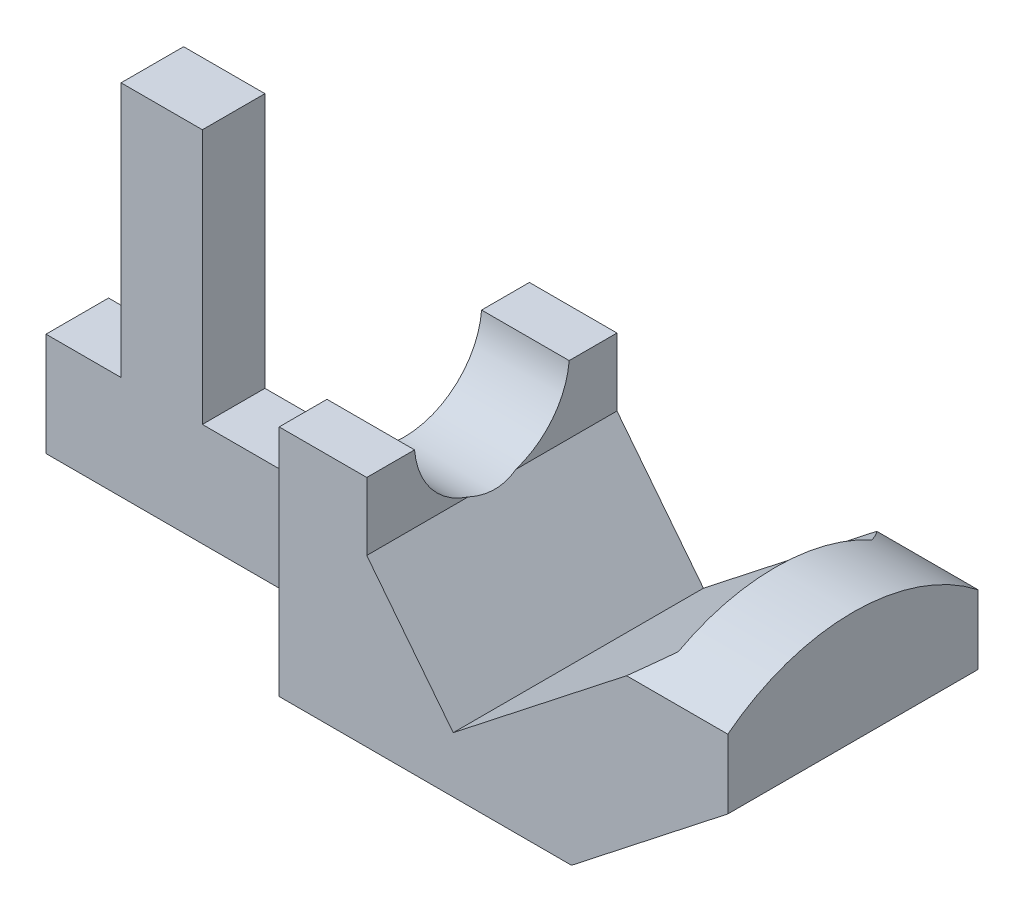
ISO-10303-21;
HEADER;
FILE_DESCRIPTION(('STEP AP214'),'2;1');
FILE_NAME('part.step','',(''),(''),'','','');
FILE_SCHEMA(('AUTOMOTIVE_DESIGN { 1 0 10303 214 1 1 1 1 }'));
ENDSEC;
DATA;
#1=APPLICATION_CONTEXT('core data for automotive mechanical design processes');
#2=APPLICATION_PROTOCOL_DEFINITION('international standard','automotive_design',2000,#1);
#3=PRODUCT_CONTEXT('',#1,'mechanical');
#4=PRODUCT('Part','Part','',(#3));
#5=PRODUCT_RELATED_PRODUCT_CATEGORY('part','',(#4));
#6=PRODUCT_DEFINITION_FORMATION('','',#4);
#7=PRODUCT_DEFINITION_CONTEXT('part definition',#1,'design');
#8=PRODUCT_DEFINITION('design','',#6,#7);
#9=PRODUCT_DEFINITION_SHAPE('','',#8);
#10=(LENGTH_UNIT() NAMED_UNIT(*) SI_UNIT(.MILLI.,.METRE.));
#11=(NAMED_UNIT(*) PLANE_ANGLE_UNIT() SI_UNIT($,.RADIAN.));
#12=(NAMED_UNIT(*) SI_UNIT($,.STERADIAN.) SOLID_ANGLE_UNIT());
#13=UNCERTAINTY_MEASURE_WITH_UNIT(LENGTH_MEASURE(1.E-05),#10,'distance_accuracy_value','');
#14=(GEOMETRIC_REPRESENTATION_CONTEXT(3) GLOBAL_UNCERTAINTY_ASSIGNED_CONTEXT((#13)) GLOBAL_UNIT_ASSIGNED_CONTEXT((#10,
#11,#12)) REPRESENTATION_CONTEXT('',''));
#15=CARTESIAN_POINT('',(0.,0.,0.));
#16=DIRECTION('',(0.,0.,1.));
#17=DIRECTION('',(1.,0.,0.));
#18=AXIS2_PLACEMENT_3D('',#15,#16,#17);
#19=CARTESIAN_POINT('',(-55.5873395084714,42.2351625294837,-3.175));
#20=DIRECTION('',(1.,0.,0.));
#21=DIRECTION('',(0.,0.,-1.));
#22=AXIS2_PLACEMENT_3D('',#19,#20,#21);
#23=PLANE('',#22);
#24=DIRECTION('',(0.,0.,1.));
#25=VECTOR('',#24,1.);
#26=CARTESIAN_POINT('',(-55.5873395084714,49.0931625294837,-12.700025));
#27=LINE('',#26,#25);
#28=CARTESIAN_POINT('',(-55.5873395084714,49.0931625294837,7.84847840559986));
#29=VERTEX_POINT('',#28);
#30=CARTESIAN_POINT('',(-55.5873395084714,49.0931625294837,12.7));
#31=VERTEX_POINT('',#30);
#32=EDGE_CURVE('E54',#29,#31,#27,.T.);
#33=ORIENTED_EDGE('',*,*,#32,.T.);
#34=DIRECTION('',(0.,1.,0.));
#35=VECTOR('',#34,1.);
#36=CARTESIAN_POINT('',(-55.5873395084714,53.2268754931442,12.7));
#37=LINE('',#36,#35);
#38=CARTESIAN_POINT('',(-55.5873395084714,42.2351625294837,12.7));
#39=VERTEX_POINT('',#38);
#40=EDGE_CURVE('E334',#39,#31,#37,.T.);
#41=ORIENTED_EDGE('',*,*,#40,.F.);
#42=DIRECTION('',(0.,0.,1.));
#43=VECTOR('',#42,1.);
#44=CARTESIAN_POINT('',(-55.5873395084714,42.2351625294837,-3.175));
#45=LINE('',#44,#43);
#46=CARTESIAN_POINT('',(-55.5873395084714,42.2351625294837,2.42446030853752));
#47=VERTEX_POINT('',#46);
#48=EDGE_CURVE('E195',#47,#39,#45,.T.);
#49=ORIENTED_EDGE('',*,*,#48,.F.);
#50=CARTESIAN_POINT('',(-55.5873395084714,49.7266155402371,0.));
#51=DIRECTION('',(1.,0.,0.));
#52=DIRECTION('',(0.,0.,-1.));
#53=AXIS2_PLACEMENT_3D('',#50,#51,#52);
#54=CIRCLE('',#53,7.874);
#55=EDGE_CURVE('E278',#29,#47,#54,.T.);
#56=ORIENTED_EDGE('',*,*,#55,.F.);
#57=EDGE_LOOP('',(#33,#41,#49,#56));
#58=FACE_BOUND('',#57,.T.);
#59=ADVANCED_FACE('F32',(#58),#23,.T.);
#60=CARTESIAN_POINT('',(-55.5873395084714,49.0931625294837,-12.7));
#61=VERTEX_POINT('',#60);
#62=CARTESIAN_POINT('',(-55.5873395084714,49.0931625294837,-7.84847840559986));
#63=VERTEX_POINT('',#62);
#64=EDGE_CURVE('E396',#61,#63,#27,.T.);
#65=ORIENTED_EDGE('',*,*,#64,.T.);
#66=CARTESIAN_POINT('',(-55.5873395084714,42.2351625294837,-2.42446030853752));
#67=VERTEX_POINT('',#66);
#68=EDGE_CURVE('E404',#67,#63,#54,.T.);
#69=ORIENTED_EDGE('',*,*,#68,.F.);
#70=CARTESIAN_POINT('',(-55.5873395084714,42.2351625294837,-12.7));
#71=VERTEX_POINT('',#70);
#72=EDGE_CURVE('E225',#71,#67,#45,.T.);
#73=ORIENTED_EDGE('',*,*,#72,.F.);
#74=DIRECTION('',(0.,1.,0.));
#75=VECTOR('',#74,1.);
#76=CARTESIAN_POINT('',(-55.5873395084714,53.2268754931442,-12.7));
#77=LINE('',#76,#75);
#78=EDGE_CURVE('E286',#71,#61,#77,.T.);
#79=ORIENTED_EDGE('',*,*,#78,.T.);
#80=EDGE_LOOP('',(#65,#69,#73,#79));
#81=FACE_BOUND('',#80,.T.);
#82=ADVANCED_FACE('F416',(#81),#23,.T.);
#83=CARTESIAN_POINT('',(-48.7685627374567,33.5429165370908,-3.175));
#84=DIRECTION('',(0.786795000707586,0.617214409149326,0.));
#85=DIRECTION('',(-0.617214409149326,0.786795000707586,0.));
#86=AXIS2_PLACEMENT_3D('',#83,#84,#85);
#87=PLANE('',#86);
#88=ORIENTED_EDGE('',*,*,#72,.T.);
#89=CARTESIAN_POINT('',(-61.4641342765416,49.7266155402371,0.));
#90=DIRECTION('',(0.786795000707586,0.617214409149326,0.));
#91=DIRECTION('',(-0.617214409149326,0.786795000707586,0.));
#92=AXIS2_PLACEMENT_3D('',#89,#90,#91);
#93=ELLIPSE('',#92,10.0076894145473,7.874);
#94=EDGE_CURVE('E277',#47,#67,#93,.T.);
#95=ORIENTED_EDGE('',*,*,#94,.F.);
#96=ORIENTED_EDGE('',*,*,#48,.T.);
#97=DIRECTION('',(-0.617214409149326,0.786795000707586,0.));
#98=VECTOR('',#97,1.);
#99=CARTESIAN_POINT('',(-46.8089069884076,31.0448424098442,12.7));
#100=LINE('',#99,#98);
#101=CARTESIAN_POINT('',(-46.8089069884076,31.0448424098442,12.7));
#102=VERTEX_POINT('',#101);
#103=EDGE_CURVE('E331',#102,#39,#100,.T.);
#104=ORIENTED_EDGE('',*,*,#103,.F.);
#105=DIRECTION('',(0.,0.,1.));
#106=VECTOR('',#105,1.);
#107=CARTESIAN_POINT('',(-46.8089069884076,31.0448424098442,-3.175));
#108=LINE('',#107,#106);
#109=CARTESIAN_POINT('',(-46.8089069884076,31.0448424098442,-12.7));
#110=VERTEX_POINT('',#109);
#111=EDGE_CURVE('E192',#110,#102,#108,.T.);
#112=ORIENTED_EDGE('',*,*,#111,.F.);
#113=DIRECTION('',(-0.617214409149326,0.786795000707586,0.));
#114=VECTOR('',#113,1.);
#115=CARTESIAN_POINT('',(-46.8089069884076,31.0448424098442,-12.7));
#116=LINE('',#115,#114);
#117=EDGE_CURVE('E289',#110,#71,#116,.T.);
#118=ORIENTED_EDGE('',*,*,#117,.T.);
#119=EDGE_LOOP('',(#88,#95,#96,#104,#112,#118));
#120=FACE_BOUND('',#119,.T.);
#121=ADVANCED_FACE('F418',(#120),#87,.T.);
#122=CARTESIAN_POINT('',(-64.4773395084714,43.5074105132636,-12.7));
#123=DIRECTION('',(-1.,0.,0.));
#124=DIRECTION('',(0.,0.,1.));
#125=AXIS2_PLACEMENT_3D('',#122,#123,#124);
#126=PLANE('',#125);
#127=DIRECTION('',(0.,0.,1.));
#128=VECTOR('',#127,1.);
#129=CARTESIAN_POINT('',(-64.4773395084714,49.0931625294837,-12.700025));
#130=LINE('',#129,#128);
#131=CARTESIAN_POINT('',(-64.4773395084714,49.0931625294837,-12.7));
#132=VERTEX_POINT('',#131);
#133=CARTESIAN_POINT('',(-64.4773395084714,49.0931625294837,-7.84847840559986));
#134=VERTEX_POINT('',#133);
#135=EDGE_CURVE('E390',#132,#134,#130,.T.);
#136=ORIENTED_EDGE('',*,*,#135,.F.);
#137=DIRECTION('',(0.,-1.,0.));
#138=VECTOR('',#137,1.);
#139=CARTESIAN_POINT('',(-64.4773395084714,43.5074105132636,-12.7));
#140=LINE('',#139,#138);
#141=CARTESIAN_POINT('',(-64.4773395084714,25.3860884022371,-12.7));
#142=VERTEX_POINT('',#141);
#143=EDGE_CURVE('E276',#132,#142,#140,.T.);
#144=ORIENTED_EDGE('',*,*,#143,.T.);
#145=DIRECTION('',(0.,0.,1.));
#146=VECTOR('',#145,1.);
#147=CARTESIAN_POINT('',(-64.4773395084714,25.3860884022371,-12.7));
#148=LINE('',#147,#146);
#149=CARTESIAN_POINT('',(-64.4773395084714,25.3860884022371,-3.175));
#150=VERTEX_POINT('',#149);
#151=EDGE_CURVE('E237',#142,#150,#148,.T.);
#152=ORIENTED_EDGE('',*,*,#151,.T.);
#153=DIRECTION('',(0.,-1.,0.));
#154=VECTOR('',#153,1.);
#155=CARTESIAN_POINT('',(-64.4773395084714,43.5074105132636,-3.175));
#156=LINE('',#155,#154);
#157=CARTESIAN_POINT('',(-64.4773395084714,35.8851625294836,-3.175));
#158=VERTEX_POINT('',#157);
#159=EDGE_CURVE('E273',#158,#150,#156,.T.);
#160=ORIENTED_EDGE('',*,*,#159,.F.);
#161=DIRECTION('',(0.,0.,-1.));
#162=VECTOR('',#161,1.);
#163=CARTESIAN_POINT('',(-64.4773395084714,35.8851625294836,3.175));
#164=LINE('',#163,#162);
#165=CARTESIAN_POINT('',(-64.4773395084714,35.8851625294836,3.175));
#166=VERTEX_POINT('',#165);
#167=EDGE_CURVE('E370',#166,#158,#164,.T.);
#168=ORIENTED_EDGE('',*,*,#167,.F.);
#169=DIRECTION('',(0.,-1.,0.));
#170=VECTOR('',#169,1.);
#171=CARTESIAN_POINT('',(-64.4773395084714,43.5074105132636,3.175));
#172=LINE('',#171,#170);
#173=CARTESIAN_POINT('',(-64.4773395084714,25.3860884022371,3.175));
#174=VERTEX_POINT('',#173);
#175=EDGE_CURVE('E267',#166,#174,#172,.T.);
#176=ORIENTED_EDGE('',*,*,#175,.T.);
#177=DIRECTION('',(0.,0.,-1.));
#178=VECTOR('',#177,1.);
#179=CARTESIAN_POINT('',(-64.4773395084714,25.3860884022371,12.7));
#180=LINE('',#179,#178);
#181=CARTESIAN_POINT('',(-64.4773395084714,25.3860884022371,12.7));
#182=VERTEX_POINT('',#181);
#183=EDGE_CURVE('E203',#182,#174,#180,.T.);
#184=ORIENTED_EDGE('',*,*,#183,.F.);
#185=DIRECTION('',(0.,-1.,0.));
#186=VECTOR('',#185,1.);
#187=CARTESIAN_POINT('',(-64.4773395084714,43.5074105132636,12.7));
#188=LINE('',#187,#186);
#189=CARTESIAN_POINT('',(-64.4773395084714,49.0931625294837,12.7));
#190=VERTEX_POINT('',#189);
#191=EDGE_CURVE('E270',#190,#182,#188,.T.);
#192=ORIENTED_EDGE('',*,*,#191,.F.);
#193=CARTESIAN_POINT('',(-64.4773395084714,49.0931625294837,7.84847840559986));
#194=VERTEX_POINT('',#193);
#195=EDGE_CURVE('E394',#194,#190,#130,.T.);
#196=ORIENTED_EDGE('',*,*,#195,.F.);
#197=CARTESIAN_POINT('',(-64.4773395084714,49.7266155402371,0.));
#198=DIRECTION('',(-1.,0.,0.));
#199=DIRECTION('',(0.,0.,1.));
#200=AXIS2_PLACEMENT_3D('',#197,#198,#199);
#201=CIRCLE('',#200,7.874);
#202=EDGE_CURVE('E211',#194,#134,#201,.F.);
#203=ORIENTED_EDGE('',*,*,#202,.T.);
#204=EDGE_LOOP('',(#136,#144,#152,#160,#168,#176,#184,#192,#196,#203));
#205=FACE_BOUND('',#204,.T.);
#206=ADVANCED_FACE('F365',(#205),#126,.T.);
#207=CARTESIAN_POINT('',(0.,0.,-3.175));
#208=DIRECTION('',(0.,0.,-1.));
#209=DIRECTION('',(1.,0.,0.));
#210=AXIS2_PLACEMENT_3D('',#207,#208,#209);
#211=PLANE('',#210);
#212=DIRECTION('',(-1.,0.,0.));
#213=VECTOR('',#212,1.);
#214=CARTESIAN_POINT('',(-81.8001395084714,35.8851625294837,-3.175));
#215=LINE('',#214,#213);
#216=CARTESIAN_POINT('',(-81.8001395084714,35.8851625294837,-3.175));
#217=VERTEX_POINT('',#216);
#218=EDGE_CURVE('E264',#158,#217,#215,.T.);
#219=ORIENTED_EDGE('',*,*,#218,.F.);
#220=ORIENTED_EDGE('',*,*,#159,.T.);
#221=DIRECTION('',(1.,0.,0.));
#222=VECTOR('',#221,1.);
#223=CARTESIAN_POINT('',(-97.6751395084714,25.3860884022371,-3.175));
#224=LINE('',#223,#222);
#225=CARTESIAN_POINT('',(-97.6751395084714,25.3860884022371,-3.175));
#226=VERTEX_POINT('',#225);
#227=EDGE_CURVE('E240',#226,#150,#224,.T.);
#228=ORIENTED_EDGE('',*,*,#227,.F.);
#229=DIRECTION('',(0.,-1.,0.));
#230=VECTOR('',#229,1.);
#231=CARTESIAN_POINT('',(-97.6751395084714,25.3860884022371,-3.175));
#232=LINE('',#231,#230);
#233=CARTESIAN_POINT('',(-97.6751395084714,35.8851625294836,-3.175));
#234=VERTEX_POINT('',#233);
#235=EDGE_CURVE('E244',#234,#226,#232,.T.);
#236=ORIENTED_EDGE('',*,*,#235,.F.);
#237=DIRECTION('',(-1.,0.,0.));
#238=VECTOR('',#237,1.);
#239=CARTESIAN_POINT('',(-97.6751395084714,35.8851625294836,-3.175));
#240=LINE('',#239,#238);
#241=CARTESIAN_POINT('',(-90.0551395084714,35.8851625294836,-3.175));
#242=VERTEX_POINT('',#241);
#243=EDGE_CURVE('E252',#242,#234,#240,.T.);
#244=ORIENTED_EDGE('',*,*,#243,.F.);
#245=DIRECTION('',(0.,-1.,0.));
#246=VECTOR('',#245,1.);
#247=CARTESIAN_POINT('',(-90.0551395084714,35.8851625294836,-3.175));
#248=LINE('',#247,#246);
#249=CARTESIAN_POINT('',(-90.0551395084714,61.7931625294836,-3.175));
#250=VERTEX_POINT('',#249);
#251=EDGE_CURVE('E255',#250,#242,#248,.T.);
#252=ORIENTED_EDGE('',*,*,#251,.F.);
#253=DIRECTION('',(-1.,0.,0.));
#254=VECTOR('',#253,1.);
#255=CARTESIAN_POINT('',(-90.0551395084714,61.7931625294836,-3.175));
#256=LINE('',#255,#254);
#257=CARTESIAN_POINT('',(-81.8001395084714,61.7931625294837,-3.175));
#258=VERTEX_POINT('',#257);
#259=EDGE_CURVE('E258',#258,#250,#256,.T.);
#260=ORIENTED_EDGE('',*,*,#259,.F.);
#261=DIRECTION('',(0.,1.,0.));
#262=VECTOR('',#261,1.);
#263=CARTESIAN_POINT('',(-81.8001395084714,61.7931625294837,-3.175));
#264=LINE('',#263,#262);
#265=EDGE_CURVE('E261',#217,#258,#264,.T.);
#266=ORIENTED_EDGE('',*,*,#265,.F.);
#267=EDGE_LOOP('',(#219,#220,#228,#236,#244,#252,#260,#266));
#268=FACE_BOUND('',#267,.T.);
#269=ADVANCED_FACE('F389',(#268),#211,.T.);
#270=CARTESIAN_POINT('',(-18.9351395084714,46.7220884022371,-3.175));
#271=DIRECTION('',(1.,0.,0.));
#272=DIRECTION('',(0.,0.,-1.));
#273=AXIS2_PLACEMENT_3D('',#270,#271,#272);
#274=PLANE('',#273);
#275=CARTESIAN_POINT('',(-18.9351395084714,28.5826625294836,0.));
#276=DIRECTION('',(-1.,0.,0.));
#277=DIRECTION('',(0.,0.,1.));
#278=AXIS2_PLACEMENT_3D('',#275,#276,#277);
#279=CIRCLE('',#278,20.6375);
#280=CARTESIAN_POINT('',(-18.9351395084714,44.8496968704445,12.7));
#281=VERTEX_POINT('',#280);
#282=CARTESIAN_POINT('',(-18.9351395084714,44.8496968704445,-12.7));
#283=VERTEX_POINT('',#282);
#284=EDGE_CURVE('E180',#281,#283,#279,.T.);
#285=ORIENTED_EDGE('',*,*,#284,.F.);
#286=DIRECTION('',(0.,1.,0.));
#287=VECTOR('',#286,1.);
#288=CARTESIAN_POINT('',(-18.9351395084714,37.8320884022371,12.7));
#289=LINE('',#288,#287);
#290=CARTESIAN_POINT('',(-18.9351395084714,37.8320884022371,12.7));
#291=VERTEX_POINT('',#290);
#292=EDGE_CURVE('E319',#291,#281,#289,.T.);
#293=ORIENTED_EDGE('',*,*,#292,.F.);
#294=DIRECTION('',(0.,0.,1.));
#295=VECTOR('',#294,1.);
#296=CARTESIAN_POINT('',(-18.9351395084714,37.8320884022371,-3.175));
#297=LINE('',#296,#295);
#298=CARTESIAN_POINT('',(-18.9351395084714,37.8320884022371,-12.7));
#299=VERTEX_POINT('',#298);
#300=EDGE_CURVE('E209',#299,#291,#297,.T.);
#301=ORIENTED_EDGE('',*,*,#300,.F.);
#302=DIRECTION('',(0.,1.,0.));
#303=VECTOR('',#302,1.);
#304=CARTESIAN_POINT('',(-18.9351395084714,37.8320884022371,-12.7));
#305=LINE('',#304,#303);
#306=EDGE_CURVE('E294',#299,#283,#305,.T.);
#307=ORIENTED_EDGE('',*,*,#306,.T.);
#308=EDGE_LOOP('',(#285,#293,#301,#307));
#309=FACE_BOUND('',#308,.T.);
#310=ADVANCED_FACE('F316',(#309),#274,.T.);
#311=CARTESIAN_POINT('',(-18.9351395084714,37.8320884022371,-3.175));
#312=DIRECTION('',(0.617214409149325,-0.786795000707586,0.));
#313=DIRECTION('',(0.786795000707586,0.617214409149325,0.));
#314=AXIS2_PLACEMENT_3D('',#311,#312,#313);
#315=PLANE('',#314);
#316=ORIENTED_EDGE('',*,*,#300,.T.);
#317=DIRECTION('',(0.786795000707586,0.617214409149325,0.));
#318=VECTOR('',#317,1.);
#319=CARTESIAN_POINT('',(-34.8006968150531,25.3860884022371,12.7));
#320=LINE('',#319,#318);
#321=CARTESIAN_POINT('',(-34.8006968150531,25.3860884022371,12.7));
#322=VERTEX_POINT('',#321);
#323=EDGE_CURVE('E323',#322,#291,#320,.T.);
#324=ORIENTED_EDGE('',*,*,#323,.F.);
#325=DIRECTION('',(0.,0.,1.));
#326=VECTOR('',#325,1.);
#327=CARTESIAN_POINT('',(-34.8006968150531,25.3860884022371,-3.175));
#328=LINE('',#327,#326);
#329=CARTESIAN_POINT('',(-34.8006968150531,25.3860884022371,-12.7));
#330=VERTEX_POINT('',#329);
#331=EDGE_CURVE('E212',#330,#322,#328,.T.);
#332=ORIENTED_EDGE('',*,*,#331,.F.);
#333=DIRECTION('',(0.786795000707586,0.617214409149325,0.));
#334=VECTOR('',#333,1.);
#335=CARTESIAN_POINT('',(-34.8006968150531,25.3860884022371,-12.7));
#336=LINE('',#335,#334);
#337=EDGE_CURVE('E296',#330,#299,#336,.T.);
#338=ORIENTED_EDGE('',*,*,#337,.T.);
#339=EDGE_LOOP('',(#316,#324,#332,#338));
#340=FACE_BOUND('',#339,.T.);
#341=ADVANCED_FACE('F322',(#340),#315,.T.);
#342=CARTESIAN_POINT('',(-97.6751395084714,25.3860884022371,-3.175));
#343=DIRECTION('',(0.,-1.,0.));
#344=DIRECTION('',(0.,0.,-1.));
#345=AXIS2_PLACEMENT_3D('',#342,#343,#344);
#346=PLANE('',#345);
#347=ORIENTED_EDGE('',*,*,#331,.T.);
#348=DIRECTION('',(1.,0.,0.));
#349=VECTOR('',#348,1.);
#350=CARTESIAN_POINT('',(-64.4773395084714,25.3860884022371,12.7));
#351=LINE('',#350,#349);
#352=EDGE_CURVE('E326',#182,#322,#351,.T.);
#353=ORIENTED_EDGE('',*,*,#352,.F.);
#354=ORIENTED_EDGE('',*,*,#183,.T.);
#355=DIRECTION('',(1.,0.,0.));
#356=VECTOR('',#355,1.);
#357=CARTESIAN_POINT('',(-97.6751395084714,25.3860884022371,3.175));
#358=LINE('',#357,#356);
#359=CARTESIAN_POINT('',(-97.6751395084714,25.3860884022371,3.175));
#360=VERTEX_POINT('',#359);
#361=EDGE_CURVE('E193',#360,#174,#358,.T.);
#362=ORIENTED_EDGE('',*,*,#361,.F.);
#363=DIRECTION('',(0.,0.,1.));
#364=VECTOR('',#363,1.);
#365=CARTESIAN_POINT('',(-97.6751395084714,25.3860884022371,-3.175));
#366=LINE('',#365,#364);
#367=EDGE_CURVE('E214',#226,#360,#366,.T.);
#368=ORIENTED_EDGE('',*,*,#367,.F.);
#369=ORIENTED_EDGE('',*,*,#227,.T.);
#370=ORIENTED_EDGE('',*,*,#151,.F.);
#371=DIRECTION('',(1.,0.,0.));
#372=VECTOR('',#371,1.);
#373=CARTESIAN_POINT('',(-64.4773395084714,25.3860884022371,-12.7));
#374=LINE('',#373,#372);
#375=EDGE_CURVE('E241',#142,#330,#374,.T.);
#376=ORIENTED_EDGE('',*,*,#375,.T.);
#377=EDGE_LOOP('',(#347,#353,#354,#362,#368,#369,#370,#376));
#378=FACE_BOUND('',#377,.T.);
#379=ADVANCED_FACE('F304',(#378),#346,.T.);
#380=CARTESIAN_POINT('',(-97.6751395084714,25.3860884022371,-3.175));
#381=DIRECTION('',(-1.,0.,0.));
#382=DIRECTION('',(0.,0.,1.));
#383=AXIS2_PLACEMENT_3D('',#380,#381,#382);
#384=PLANE('',#383);
#385=DIRECTION('',(0.,0.,1.));
#386=VECTOR('',#385,1.);
#387=CARTESIAN_POINT('',(-97.6751395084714,35.8851625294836,-3.175));
#388=LINE('',#387,#386);
#389=CARTESIAN_POINT('',(-97.6751395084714,35.8851625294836,3.175));
#390=VERTEX_POINT('',#389);
#391=EDGE_CURVE('E216',#234,#390,#388,.T.);
#392=ORIENTED_EDGE('',*,*,#391,.F.);
#393=ORIENTED_EDGE('',*,*,#235,.T.);
#394=ORIENTED_EDGE('',*,*,#367,.T.);
#395=DIRECTION('',(0.,-1.,0.));
#396=VECTOR('',#395,1.);
#397=CARTESIAN_POINT('',(-97.6751395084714,25.3860884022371,3.175));
#398=LINE('',#397,#396);
#399=EDGE_CURVE('E198',#390,#360,#398,.T.);
#400=ORIENTED_EDGE('',*,*,#399,.F.);
#401=EDGE_LOOP('',(#392,#393,#394,#400));
#402=FACE_BOUND('',#401,.T.);
#403=ADVANCED_FACE('F358',(#402),#384,.T.);
#404=CARTESIAN_POINT('',(-97.6751395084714,35.8851625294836,-3.175));
#405=DIRECTION('',(0.,1.,0.));
#406=DIRECTION('',(-1.,0.,0.));
#407=AXIS2_PLACEMENT_3D('',#404,#405,#406);
#408=PLANE('',#407);
#409=DIRECTION('',(0.,0.,1.));
#410=VECTOR('',#409,1.);
#411=CARTESIAN_POINT('',(-90.0551395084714,35.8851625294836,-3.175));
#412=LINE('',#411,#410);
#413=CARTESIAN_POINT('',(-90.0551395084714,35.8851625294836,3.175));
#414=VERTEX_POINT('',#413);
#415=EDGE_CURVE('E218',#242,#414,#412,.T.);
#416=ORIENTED_EDGE('',*,*,#415,.F.);
#417=ORIENTED_EDGE('',*,*,#243,.T.);
#418=ORIENTED_EDGE('',*,*,#391,.T.);
#419=DIRECTION('',(-1.,0.,0.));
#420=VECTOR('',#419,1.);
#421=CARTESIAN_POINT('',(-97.6751395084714,35.8851625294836,3.175));
#422=LINE('',#421,#420);
#423=EDGE_CURVE('E348',#414,#390,#422,.T.);
#424=ORIENTED_EDGE('',*,*,#423,.F.);
#425=EDGE_LOOP('',(#416,#417,#418,#424));
#426=FACE_BOUND('',#425,.T.);
#427=ADVANCED_FACE('F387',(#426),#408,.T.);
#428=CARTESIAN_POINT('',(-90.0551395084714,35.8851625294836,-3.175));
#429=DIRECTION('',(-1.,0.,0.));
#430=DIRECTION('',(0.,0.,1.));
#431=AXIS2_PLACEMENT_3D('',#428,#429,#430);
#432=PLANE('',#431);
#433=DIRECTION('',(0.,0.,1.));
#434=VECTOR('',#433,1.);
#435=CARTESIAN_POINT('',(-90.0551395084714,61.7931625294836,-3.175));
#436=LINE('',#435,#434);
#437=CARTESIAN_POINT('',(-90.0551395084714,61.7931625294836,3.175));
#438=VERTEX_POINT('',#437);
#439=EDGE_CURVE('E220',#250,#438,#436,.T.);
#440=ORIENTED_EDGE('',*,*,#439,.F.);
#441=ORIENTED_EDGE('',*,*,#251,.T.);
#442=ORIENTED_EDGE('',*,*,#415,.T.);
#443=DIRECTION('',(0.,-1.,0.));
#444=VECTOR('',#443,1.);
#445=CARTESIAN_POINT('',(-90.0551395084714,35.8851625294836,3.175));
#446=LINE('',#445,#444);
#447=EDGE_CURVE('E346',#438,#414,#446,.T.);
#448=ORIENTED_EDGE('',*,*,#447,.F.);
#449=EDGE_LOOP('',(#440,#441,#442,#448));
#450=FACE_BOUND('',#449,.T.);
#451=ADVANCED_FACE('F383',(#450),#432,.T.);
#452=CARTESIAN_POINT('',(-90.0551395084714,61.7931625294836,-3.175));
#453=DIRECTION('',(0.,1.,0.));
#454=DIRECTION('',(-1.,0.,0.));
#455=AXIS2_PLACEMENT_3D('',#452,#453,#454);
#456=PLANE('',#455);
#457=DIRECTION('',(0.,0.,1.));
#458=VECTOR('',#457,1.);
#459=CARTESIAN_POINT('',(-81.8001395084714,61.7931625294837,-3.175));
#460=LINE('',#459,#458);
#461=CARTESIAN_POINT('',(-81.8001395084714,61.7931625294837,3.175));
#462=VERTEX_POINT('',#461);
#463=EDGE_CURVE('E222',#258,#462,#460,.T.);
#464=ORIENTED_EDGE('',*,*,#463,.F.);
#465=ORIENTED_EDGE('',*,*,#259,.T.);
#466=ORIENTED_EDGE('',*,*,#439,.T.);
#467=DIRECTION('',(-1.,0.,0.));
#468=VECTOR('',#467,1.);
#469=CARTESIAN_POINT('',(-90.0551395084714,61.7931625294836,3.175));
#470=LINE('',#469,#468);
#471=EDGE_CURVE('E343',#462,#438,#470,.T.);
#472=ORIENTED_EDGE('',*,*,#471,.F.);
#473=EDGE_LOOP('',(#464,#465,#466,#472));
#474=FACE_BOUND('',#473,.T.);
#475=ADVANCED_FACE('F380',(#474),#456,.T.);
#476=CARTESIAN_POINT('',(-81.8001395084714,61.7931625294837,-3.175));
#477=DIRECTION('',(1.,0.,0.));
#478=DIRECTION('',(0.,0.,-1.));
#479=AXIS2_PLACEMENT_3D('',#476,#477,#478);
#480=PLANE('',#479);
#481=DIRECTION('',(0.,0.,1.));
#482=VECTOR('',#481,1.);
#483=CARTESIAN_POINT('',(-81.8001395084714,35.8851625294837,-3.175));
#484=LINE('',#483,#482);
#485=CARTESIAN_POINT('',(-81.8001395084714,35.8851625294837,3.175));
#486=VERTEX_POINT('',#485);
#487=EDGE_CURVE('E224',#217,#486,#484,.T.);
#488=ORIENTED_EDGE('',*,*,#487,.F.);
#489=ORIENTED_EDGE('',*,*,#265,.T.);
#490=ORIENTED_EDGE('',*,*,#463,.T.);
#491=DIRECTION('',(0.,1.,0.));
#492=VECTOR('',#491,1.);
#493=CARTESIAN_POINT('',(-81.8001395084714,61.7931625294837,3.175));
#494=LINE('',#493,#492);
#495=EDGE_CURVE('E340',#486,#462,#494,.T.);
#496=ORIENTED_EDGE('',*,*,#495,.F.);
#497=EDGE_LOOP('',(#488,#489,#490,#496));
#498=FACE_BOUND('',#497,.T.);
#499=ADVANCED_FACE('F376',(#498),#480,.T.);
#500=CARTESIAN_POINT('',(-81.8001395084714,35.8851625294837,-3.175));
#501=DIRECTION('',(0.,1.,0.));
#502=DIRECTION('',(0.,0.,1.));
#503=AXIS2_PLACEMENT_3D('',#500,#501,#502);
#504=PLANE('',#503);
#505=DIRECTION('',(-1.,0.,0.));
#506=VECTOR('',#505,1.);
#507=CARTESIAN_POINT('',(-81.8001395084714,35.8851625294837,3.175));
#508=LINE('',#507,#506);
#509=EDGE_CURVE('E337',#166,#486,#508,.T.);
#510=ORIENTED_EDGE('',*,*,#509,.F.);
#511=ORIENTED_EDGE('',*,*,#167,.T.);
#512=ORIENTED_EDGE('',*,*,#218,.T.);
#513=ORIENTED_EDGE('',*,*,#487,.T.);
#514=EDGE_LOOP('',(#510,#511,#512,#513));
#515=FACE_BOUND('',#514,.T.);
#516=ADVANCED_FACE('F373',(#515),#504,.T.);
#517=CARTESIAN_POINT('',(-26.8243139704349,46.7220884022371,-3.175));
#518=DIRECTION('',(-0.617214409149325,0.786795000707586,0.));
#519=DIRECTION('',(-0.786795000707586,-0.617214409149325,0.));
#520=AXIS2_PLACEMENT_3D('',#517,#518,#519);
#521=PLANE('',#520);
#522=CARTESIAN_POINT('',(-49.9475745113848,28.5826625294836,0.));
#523=DIRECTION('',(-0.617214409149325,0.786795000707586,0.));
#524=DIRECTION('',(0.786795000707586,0.617214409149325,0.));
#525=AXIS2_PLACEMENT_3D('',#522,#523,#524);
#526=ELLIPSE('',#525,33.4365168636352,20.6375);
#527=CARTESIAN_POINT('',(-29.2111479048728,44.8496968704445,12.7));
#528=VERTEX_POINT('',#527);
#529=CARTESIAN_POINT('',(-26.8243139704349,46.7220884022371,9.84213570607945));
#530=VERTEX_POINT('',#529);
#531=EDGE_CURVE('E174',#528,#530,#526,.T.);
#532=ORIENTED_EDGE('',*,*,#531,.T.);
#533=DIRECTION('',(0.,0.,1.));
#534=VECTOR('',#533,1.);
#535=CARTESIAN_POINT('',(-26.8243139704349,46.7220884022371,-3.175));
#536=LINE('',#535,#534);
#537=CARTESIAN_POINT('',(-26.8243139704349,46.7220884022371,-9.84213570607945));
#538=VERTEX_POINT('',#537);
#539=EDGE_CURVE('E185',#538,#530,#536,.T.);
#540=ORIENTED_EDGE('',*,*,#539,.F.);
#541=CARTESIAN_POINT('',(-29.2111479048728,44.8496968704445,-12.7));
#542=VERTEX_POINT('',#541);
#543=EDGE_CURVE('E47',#538,#542,#526,.T.);
#544=ORIENTED_EDGE('',*,*,#543,.T.);
#545=DIRECTION('',(-0.786795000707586,-0.617214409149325,0.));
#546=VECTOR('',#545,1.);
#547=CARTESIAN_POINT('',(-26.8243139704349,46.7220884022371,-12.7));
#548=LINE('',#547,#546);
#549=EDGE_CURVE('E292',#542,#110,#548,.T.);
#550=ORIENTED_EDGE('',*,*,#549,.T.);
#551=ORIENTED_EDGE('',*,*,#111,.T.);
#552=DIRECTION('',(-0.786795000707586,-0.617214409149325,0.));
#553=VECTOR('',#552,1.);
#554=CARTESIAN_POINT('',(-26.8243139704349,46.7220884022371,12.7));
#555=LINE('',#554,#553);
#556=EDGE_CURVE('E187',#528,#102,#555,.T.);
#557=ORIENTED_EDGE('',*,*,#556,.F.);
#558=EDGE_LOOP('',(#532,#540,#544,#550,#551,#557));
#559=FACE_BOUND('',#558,.T.);
#560=ADVANCED_FACE('F184',(#559),#521,.T.);
#561=CARTESIAN_POINT('',(0.,0.,3.175));
#562=DIRECTION('',(0.,0.,1.));
#563=DIRECTION('',(1.,0.,0.));
#564=AXIS2_PLACEMENT_3D('',#561,#562,#563);
#565=PLANE('',#564);
#566=ORIENTED_EDGE('',*,*,#175,.F.);
#567=ORIENTED_EDGE('',*,*,#509,.T.);
#568=ORIENTED_EDGE('',*,*,#495,.T.);
#569=ORIENTED_EDGE('',*,*,#471,.T.);
#570=ORIENTED_EDGE('',*,*,#447,.T.);
#571=ORIENTED_EDGE('',*,*,#423,.T.);
#572=ORIENTED_EDGE('',*,*,#399,.T.);
#573=ORIENTED_EDGE('',*,*,#361,.T.);
#574=EDGE_LOOP('',(#566,#567,#568,#569,#570,#571,#572,#573));
#575=FACE_BOUND('',#574,.T.);
#576=ADVANCED_FACE('F34',(#575),#565,.T.);
#577=CARTESIAN_POINT('',(-64.4773395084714,53.2268754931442,12.7));
#578=DIRECTION('',(0.,0.,-1.));
#579=DIRECTION('',(-1.,0.,0.));
#580=AXIS2_PLACEMENT_3D('',#577,#578,#579);
#581=PLANE('',#580);
#582=ORIENTED_EDGE('',*,*,#292,.T.);
#583=DIRECTION('',(1.,0.,0.));
#584=VECTOR('',#583,1.);
#585=CARTESIAN_POINT('',(-97.6761645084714,44.8496968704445,12.7));
#586=LINE('',#585,#584);
#587=EDGE_CURVE('E188',#528,#281,#586,.T.);
#588=ORIENTED_EDGE('',*,*,#587,.F.);
#589=ORIENTED_EDGE('',*,*,#556,.T.);
#590=ORIENTED_EDGE('',*,*,#103,.T.);
#591=ORIENTED_EDGE('',*,*,#40,.T.);
#592=DIRECTION('',(1.,0.,0.));
#593=VECTOR('',#592,1.);
#594=CARTESIAN_POINT('',(-64.4773395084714,49.0931625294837,12.7));
#595=LINE('',#594,#593);
#596=EDGE_CURVE('E179',#190,#31,#595,.T.);
#597=ORIENTED_EDGE('',*,*,#596,.F.);
#598=ORIENTED_EDGE('',*,*,#191,.T.);
#599=ORIENTED_EDGE('',*,*,#352,.T.);
#600=ORIENTED_EDGE('',*,*,#323,.T.);
#601=EDGE_LOOP('',(#582,#588,#589,#590,#591,#597,#598,#599,#600));
#602=FACE_BOUND('',#601,.T.);
#603=ADVANCED_FACE('F325',(#602),#581,.F.);
#604=CARTESIAN_POINT('',(-64.4773395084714,53.2268754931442,-12.7));
#605=DIRECTION('',(0.,0.,1.));
#606=DIRECTION('',(-1.,0.,0.));
#607=AXIS2_PLACEMENT_3D('',#604,#605,#606);
#608=PLANE('',#607);
#609=ORIENTED_EDGE('',*,*,#549,.F.);
#610=DIRECTION('',(1.,0.,0.));
#611=VECTOR('',#610,1.);
#612=CARTESIAN_POINT('',(-97.6761645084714,44.8496968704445,-12.7));
#613=LINE('',#612,#611);
#614=EDGE_CURVE('E189',#542,#283,#613,.T.);
#615=ORIENTED_EDGE('',*,*,#614,.T.);
#616=ORIENTED_EDGE('',*,*,#306,.F.);
#617=ORIENTED_EDGE('',*,*,#337,.F.);
#618=ORIENTED_EDGE('',*,*,#375,.F.);
#619=ORIENTED_EDGE('',*,*,#143,.F.);
#620=DIRECTION('',(1.,0.,0.));
#621=VECTOR('',#620,1.);
#622=CARTESIAN_POINT('',(-64.4773395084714,49.0931625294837,-12.7));
#623=LINE('',#622,#621);
#624=EDGE_CURVE('E400',#132,#61,#623,.T.);
#625=ORIENTED_EDGE('',*,*,#624,.T.);
#626=ORIENTED_EDGE('',*,*,#78,.F.);
#627=ORIENTED_EDGE('',*,*,#117,.F.);
#628=EDGE_LOOP('',(#609,#615,#616,#617,#618,#619,#625,#626,#627));
#629=FACE_BOUND('',#628,.T.);
#630=ADVANCED_FACE('F310',(#629),#608,.F.);
#631=CARTESIAN_POINT('',(-18.9341395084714,49.7266155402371,0.));
#632=DIRECTION('',(-1.,0.,0.));
#633=DIRECTION('',(0.,0.,1.));
#634=AXIS2_PLACEMENT_3D('',#631,#632,#633);
#635=CYLINDRICAL_SURFACE('',#634,7.874);
#636=DIRECTION('',(-1.,0.,0.));
#637=VECTOR('',#636,1.);
#638=CARTESIAN_POINT('',(-18.9341395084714,49.0931625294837,7.84847840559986));
#639=LINE('',#638,#637);
#640=EDGE_CURVE('E12',#29,#194,#639,.T.);
#641=ORIENTED_EDGE('',*,*,#640,.F.);
#642=ORIENTED_EDGE('',*,*,#55,.T.);
#643=ORIENTED_EDGE('',*,*,#94,.T.);
#644=ORIENTED_EDGE('',*,*,#68,.T.);
#645=DIRECTION('',(-1.,0.,0.));
#646=VECTOR('',#645,1.);
#647=CARTESIAN_POINT('',(-18.9341395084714,49.0931625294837,-7.84847840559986));
#648=LINE('',#647,#646);
#649=EDGE_CURVE('E40',#134,#63,#648,.F.);
#650=ORIENTED_EDGE('',*,*,#649,.F.);
#651=ORIENTED_EDGE('',*,*,#202,.F.);
#652=EDGE_LOOP('',(#641,#642,#643,#644,#650,#651));
#653=FACE_BOUND('',#652,.T.);
#654=ADVANCED_FACE('F410',(#653),#635,.F.);
#655=CARTESIAN_POINT('',(-64.4773395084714,49.0931625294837,-12.700025));
#656=DIRECTION('',(0.,-1.,0.));
#657=DIRECTION('',(0.,0.,-1.));
#658=AXIS2_PLACEMENT_3D('',#655,#656,#657);
#659=PLANE('',#658);
#660=ORIENTED_EDGE('',*,*,#135,.T.);
#661=ORIENTED_EDGE('',*,*,#649,.T.);
#662=ORIENTED_EDGE('',*,*,#64,.F.);
#663=ORIENTED_EDGE('',*,*,#624,.F.);
#664=EDGE_LOOP('',(#660,#661,#662,#663));
#665=FACE_BOUND('',#664,.T.);
#666=ADVANCED_FACE('F422',(#665),#659,.F.);
#667=ORIENTED_EDGE('',*,*,#640,.T.);
#668=ORIENTED_EDGE('',*,*,#195,.T.);
#669=ORIENTED_EDGE('',*,*,#596,.T.);
#670=ORIENTED_EDGE('',*,*,#32,.F.);
#671=EDGE_LOOP('',(#667,#668,#669,#670));
#672=FACE_BOUND('',#671,.T.);
#673=ADVANCED_FACE('F429',(#672),#659,.F.);
#674=CARTESIAN_POINT('',(-26.8243139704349,55.358088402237,-12.7));
#675=DIRECTION('',(1.,0.,0.));
#676=DIRECTION('',(0.,0.,-1.));
#677=AXIS2_PLACEMENT_3D('',#674,#675,#676);
#678=PLANE('',#677);
#679=ORIENTED_EDGE('',*,*,#539,.T.);
#680=CARTESIAN_POINT('',(-26.8243139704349,28.5826625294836,0.));
#681=DIRECTION('',(1.,0.,0.));
#682=DIRECTION('',(0.,0.,-1.));
#683=AXIS2_PLACEMENT_3D('',#680,#681,#682);
#684=CIRCLE('',#683,20.6375);
#685=EDGE_CURVE('E171',#538,#530,#684,.T.);
#686=ORIENTED_EDGE('',*,*,#685,.F.);
#687=EDGE_LOOP('',(#679,#686));
#688=FACE_BOUND('',#687,.T.);
#689=ADVANCED_FACE('F191',(#688),#678,.F.);
#690=CARTESIAN_POINT('',(-97.6761645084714,28.5826625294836,0.));
#691=DIRECTION('',(1.,0.,0.));
#692=DIRECTION('',(0.,0.,-1.));
#693=AXIS2_PLACEMENT_3D('',#690,#691,#692);
#694=CYLINDRICAL_SURFACE('',#693,20.6375);
#695=ORIENTED_EDGE('',*,*,#685,.T.);
#696=ORIENTED_EDGE('',*,*,#531,.F.);
#697=ORIENTED_EDGE('',*,*,#587,.T.);
#698=ORIENTED_EDGE('',*,*,#284,.T.);
#699=ORIENTED_EDGE('',*,*,#614,.F.);
#700=ORIENTED_EDGE('',*,*,#543,.F.);
#701=EDGE_LOOP('',(#695,#696,#697,#698,#699,#700));
#702=FACE_BOUND('',#701,.T.);
#703=ADVANCED_FACE('F173',(#702),#694,.T.);
#704=CLOSED_SHELL('',(#59,#82,#121,#206,#269,#310,#341,#379,#403,#427,#451,#475,#499,#516,#560,
#576,#603,#630,#654,#666,#673,#689,#703));
#705=MANIFOLD_SOLID_BREP('B2',#704);
#706=ADVANCED_BREP_SHAPE_REPRESENTATION('',(#18,#705),#14);
#707=SHAPE_DEFINITION_REPRESENTATION(#9,#706);
ENDSEC;
END-ISO-10303-21;
